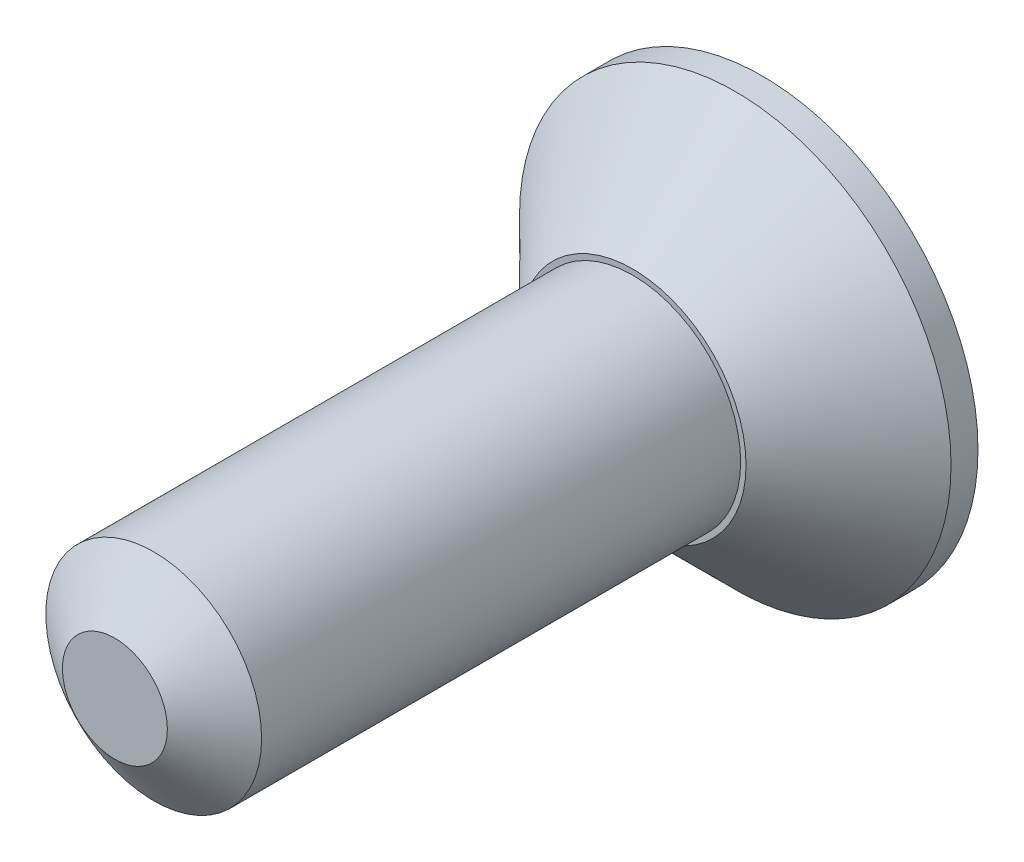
ISO-10303-21;
HEADER;
FILE_DESCRIPTION(('STEP AP214'),'2;1');
FILE_NAME('part.step','',(''),(''),'','','');
FILE_SCHEMA(('AUTOMOTIVE_DESIGN { 1 0 10303 214 1 1 1 1 }'));
ENDSEC;
DATA;
#1=APPLICATION_CONTEXT('core data for automotive mechanical design processes');
#2=APPLICATION_PROTOCOL_DEFINITION('international standard','automotive_design',2000,#1);
#3=PRODUCT_CONTEXT('',#1,'mechanical');
#4=PRODUCT('Part','Part','',(#3));
#5=PRODUCT_RELATED_PRODUCT_CATEGORY('part','',(#4));
#6=PRODUCT_DEFINITION_FORMATION('','',#4);
#7=PRODUCT_DEFINITION_CONTEXT('part definition',#1,'design');
#8=PRODUCT_DEFINITION('design','',#6,#7);
#9=PRODUCT_DEFINITION_SHAPE('','',#8);
#10=(LENGTH_UNIT() NAMED_UNIT(*) SI_UNIT(.MILLI.,.METRE.));
#11=(NAMED_UNIT(*) PLANE_ANGLE_UNIT() SI_UNIT($,.RADIAN.));
#12=(NAMED_UNIT(*) SI_UNIT($,.STERADIAN.) SOLID_ANGLE_UNIT());
#13=UNCERTAINTY_MEASURE_WITH_UNIT(LENGTH_MEASURE(1.E-05),#10,'distance_accuracy_value','');
#14=(GEOMETRIC_REPRESENTATION_CONTEXT(3) GLOBAL_UNCERTAINTY_ASSIGNED_CONTEXT((#13)) GLOBAL_UNIT_ASSIGNED_CONTEXT((#10,
#11,#12)) REPRESENTATION_CONTEXT('',''));
#15=CARTESIAN_POINT('',(0.,0.,0.));
#16=DIRECTION('',(0.,0.,1.));
#17=DIRECTION('',(1.,0.,0.));
#18=AXIS2_PLACEMENT_3D('',#15,#16,#17);
#19=CARTESIAN_POINT('',(0.,0.,-6.));
#20=DIRECTION('',(0.,0.,1.));
#21=DIRECTION('',(1.,0.,0.));
#22=AXIS2_PLACEMENT_3D('',#19,#20,#21);
#23=PLANE('',#22);
#24=CARTESIAN_POINT('',(0.,0.,-6.));
#25=DIRECTION('',(0.,0.,-1.));
#26=DIRECTION('',(-1.,0.,0.));
#27=AXIS2_PLACEMENT_3D('',#24,#25,#26);
#28=CIRCLE('',#27,2.);
#29=CARTESIAN_POINT('',(-2.,0.,-6.));
#30=VERTEX_POINT('',#29);
#31=EDGE_CURVE('E132',#30,#30,#28,.T.);
#32=ORIENTED_EDGE('',*,*,#31,.T.);
#33=EDGE_LOOP('',(#32));
#34=FACE_BOUND('',#33,.T.);
#35=CARTESIAN_POINT('',(0.,0.,-6.));
#36=DIRECTION('',(0.,0.,1.));
#37=DIRECTION('',(1.,0.,0.));
#38=AXIS2_PLACEMENT_3D('',#35,#36,#37);
#39=CIRCLE('',#38,0.750555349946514);
#40=CARTESIAN_POINT('',(0.,-0.750555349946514,-6.));
#41=VERTEX_POINT('',#40);
#42=CARTESIAN_POINT('',(0.649999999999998,-0.375277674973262,-6.));
#43=VERTEX_POINT('',#42);
#44=EDGE_CURVE('E209',#41,#43,#39,.T.);
#45=ORIENTED_EDGE('',*,*,#44,.T.);
#46=CARTESIAN_POINT('',(0.649999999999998,0.375277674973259,-6.));
#47=VERTEX_POINT('',#46);
#48=EDGE_CURVE('E206',#43,#47,#39,.T.);
#49=ORIENTED_EDGE('',*,*,#48,.T.);
#50=CARTESIAN_POINT('',(0.,0.750555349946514,-6.));
#51=VERTEX_POINT('',#50);
#52=EDGE_CURVE('E202',#47,#51,#39,.T.);
#53=ORIENTED_EDGE('',*,*,#52,.T.);
#54=CARTESIAN_POINT('',(-0.649999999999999,0.375277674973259,-6.));
#55=VERTEX_POINT('',#54);
#56=EDGE_CURVE('E55',#51,#55,#39,.T.);
#57=ORIENTED_EDGE('',*,*,#56,.T.);
#58=CARTESIAN_POINT('',(-0.650000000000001,-0.375277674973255,-6.));
#59=VERTEX_POINT('',#58);
#60=EDGE_CURVE('E62',#55,#59,#39,.T.);
#61=ORIENTED_EDGE('',*,*,#60,.T.);
#62=EDGE_CURVE('E211',#59,#41,#39,.T.);
#63=ORIENTED_EDGE('',*,*,#62,.T.);
#64=EDGE_LOOP('',(#45,#49,#53,#57,#61,#63));
#65=FACE_BOUND('',#64,.T.);
#66=ADVANCED_FACE('F36',(#34,#65),#23,.F.);
#67=CARTESIAN_POINT('',(0.,0.,-6.));
#68=DIRECTION('',(0.,0.,1.));
#69=DIRECTION('',(1.,0.,0.));
#70=AXIS2_PLACEMENT_3D('',#67,#68,#69);
#71=CYLINDRICAL_SURFACE('',#70,1.);
#72=CARTESIAN_POINT('',(0.,0.,-0.359771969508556));
#73=DIRECTION('',(0.,0.,1.));
#74=DIRECTION('',(1.,0.,0.));
#75=AXIS2_PLACEMENT_3D('',#72,#73,#74);
#76=CIRCLE('',#75,1.);
#77=CARTESIAN_POINT('',(1.,0.,-0.359771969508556));
#78=VERTEX_POINT('',#77);
#79=EDGE_CURVE('E49',#78,#78,#76,.T.);
#80=ORIENTED_EDGE('',*,*,#79,.F.);
#81=EDGE_LOOP('',(#80));
#82=FACE_BOUND('',#81,.T.);
#83=CARTESIAN_POINT('',(0.,0.,-4.8));
#84=DIRECTION('',(0.,0.,-1.));
#85=DIRECTION('',(-1.,0.,0.));
#86=AXIS2_PLACEMENT_3D('',#83,#84,#85);
#87=CIRCLE('',#86,1.);
#88=CARTESIAN_POINT('',(-1.,0.,-4.8));
#89=VERTEX_POINT('',#88);
#90=EDGE_CURVE('E135',#89,#89,#87,.F.);
#91=ORIENTED_EDGE('',*,*,#90,.T.);
#92=EDGE_LOOP('',(#91));
#93=FACE_BOUND('',#92,.T.);
#94=ADVANCED_FACE('F38',(#82,#93),#71,.T.);
#95=CARTESIAN_POINT('',(0.,0.,0.));
#96=DIRECTION('',(0.,0.,-1.));
#97=DIRECTION('',(-1.,0.,0.));
#98=AXIS2_PLACEMENT_3D('',#95,#96,#97);
#99=CONICAL_SURFACE('',#98,0.486192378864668,0.959931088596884);
#100=ORIENTED_EDGE('',*,*,#79,.T.);
#101=EDGE_LOOP('',(#100));
#102=FACE_BOUND('',#101,.T.);
#103=CARTESIAN_POINT('',(0.,0.,0.));
#104=DIRECTION('',(0.,0.,1.));
#105=DIRECTION('',(1.,0.,0.));
#106=AXIS2_PLACEMENT_3D('',#103,#104,#105);
#107=CIRCLE('',#106,0.486192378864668);
#108=CARTESIAN_POINT('',(0.486192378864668,0.,0.));
#109=VERTEX_POINT('',#108);
#110=EDGE_CURVE('E136',#109,#109,#107,.T.);
#111=ORIENTED_EDGE('',*,*,#110,.F.);
#112=EDGE_LOOP('',(#111));
#113=FACE_BOUND('',#112,.T.);
#114=ADVANCED_FACE('F157',(#102,#113),#99,.T.);
#115=CARTESIAN_POINT('',(0.,0.,0.));
#116=DIRECTION('',(0.,0.,1.));
#117=DIRECTION('',(1.,0.,0.));
#118=AXIS2_PLACEMENT_3D('',#115,#116,#117);
#119=PLANE('',#118);
#120=ORIENTED_EDGE('',*,*,#110,.T.);
#121=EDGE_LOOP('',(#120));
#122=FACE_BOUND('',#121,.T.);
#123=ADVANCED_FACE('F147',(#122),#119,.T.);
#124=CARTESIAN_POINT('',(0.,0.,-4.8));
#125=DIRECTION('',(0.,0.,-1.));
#126=DIRECTION('',(-1.,0.,0.));
#127=AXIS2_PLACEMENT_3D('',#124,#125,#126);
#128=PLANE('',#127);
#129=CARTESIAN_POINT('',(0.,0.,-4.8));
#130=DIRECTION('',(0.,0.,1.));
#131=DIRECTION('',(1.,0.,0.));
#132=AXIS2_PLACEMENT_3D('',#129,#130,#131);
#133=CIRCLE('',#132,1.05);
#134=CARTESIAN_POINT('',(1.05,0.,-4.8));
#135=VERTEX_POINT('',#134);
#136=EDGE_CURVE('E120',#135,#135,#133,.T.);
#137=ORIENTED_EDGE('',*,*,#136,.T.);
#138=EDGE_LOOP('',(#137));
#139=FACE_BOUND('',#138,.T.);
#140=ORIENTED_EDGE('',*,*,#90,.F.);
#141=EDGE_LOOP('',(#140));
#142=FACE_BOUND('',#141,.T.);
#143=ADVANCED_FACE('F144',(#139,#142),#128,.F.);
#144=CARTESIAN_POINT('',(0.,0.,-5.75000000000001));
#145=DIRECTION('',(0.,0.,-1.));
#146=DIRECTION('',(-1.,0.,0.));
#147=AXIS2_PLACEMENT_3D('',#144,#145,#146);
#148=CONICAL_SURFACE('',#147,2.,0.785398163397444);
#149=ORIENTED_EDGE('',*,*,#136,.F.);
#150=EDGE_LOOP('',(#149));
#151=FACE_BOUND('',#150,.T.);
#152=CARTESIAN_POINT('',(0.,0.,-5.75000000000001));
#153=DIRECTION('',(0.,0.,1.));
#154=DIRECTION('',(1.,0.,0.));
#155=AXIS2_PLACEMENT_3D('',#152,#153,#154);
#156=CIRCLE('',#155,2.);
#157=CARTESIAN_POINT('',(2.,0.,-5.75000000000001));
#158=VERTEX_POINT('',#157);
#159=EDGE_CURVE('E124',#158,#158,#156,.T.);
#160=ORIENTED_EDGE('',*,*,#159,.T.);
#161=EDGE_LOOP('',(#160));
#162=FACE_BOUND('',#161,.T.);
#163=ADVANCED_FACE('F146',(#151,#162),#148,.T.);
#164=CARTESIAN_POINT('',(0.,0.,-4.8));
#165=DIRECTION('',(0.,0.,-1.));
#166=DIRECTION('',(-1.,0.,0.));
#167=AXIS2_PLACEMENT_3D('',#164,#165,#166);
#168=CYLINDRICAL_SURFACE('',#167,2.);
#169=ORIENTED_EDGE('',*,*,#159,.F.);
#170=EDGE_LOOP('',(#169));
#171=FACE_BOUND('',#170,.T.);
#172=ORIENTED_EDGE('',*,*,#31,.F.);
#173=EDGE_LOOP('',(#172));
#174=FACE_BOUND('',#173,.T.);
#175=ADVANCED_FACE('F154',(#171,#174),#168,.T.);
#176=CARTESIAN_POINT('',(0.,0.,-6.));
#177=DIRECTION('',(0.,0.,-1.));
#178=DIRECTION('',(1.,0.,0.));
#179=AXIS2_PLACEMENT_3D('',#176,#177,#178);
#180=CONICAL_SURFACE('',#179,0.750555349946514,0.78539816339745);
#181=ORIENTED_EDGE('',*,*,#48,.F.);
#182=CARTESIAN_POINT('',(0.649999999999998,-0.748456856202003,-6.24075069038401));
#183=CARTESIAN_POINT('',(0.649999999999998,-0.711991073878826,-6.21328028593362));
#184=CARTESIAN_POINT('',(0.649999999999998,-0.675139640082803,-6.1862651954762));
#185=CARTESIAN_POINT('',(0.649999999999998,-0.600031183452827,-6.13362934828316));
#186=CARTESIAN_POINT('',(0.649999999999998,-0.561765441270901,-6.1080211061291));
#187=CARTESIAN_POINT('',(0.649999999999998,-0.481525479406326,-6.05773749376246));
#188=CARTESIAN_POINT('',(0.649999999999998,-0.439464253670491,-6.03319880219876));
#189=CARTESIAN_POINT('',(0.649999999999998,-0.353242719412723,-5.98831465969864));
#190=CARTESIAN_POINT('',(0.649999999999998,-0.309090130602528,-5.96795507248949));
#191=CARTESIAN_POINT('',(0.649999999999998,-0.242810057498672,-5.94304872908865));
#192=CARTESIAN_POINT('',(0.649999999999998,-0.221667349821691,-5.93590072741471));
#193=CARTESIAN_POINT('',(0.649999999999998,-0.178882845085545,-5.92329752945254));
#194=CARTESIAN_POINT('',(0.649999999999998,-0.157241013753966,-5.91784244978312));
#195=CARTESIAN_POINT('',(0.649999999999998,-0.0924732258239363,-5.90466076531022));
#196=CARTESIAN_POINT('',(0.649999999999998,-0.0486986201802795,-5.89979355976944));
#197=CARTESIAN_POINT('',(0.649999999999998,0.0373331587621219,-5.89914448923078));
#198=CARTESIAN_POINT('',(0.649999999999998,0.0795879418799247,-5.9030403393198));
#199=CARTESIAN_POINT('',(0.649999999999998,0.142230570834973,-5.91449232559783));
#200=CARTESIAN_POINT('',(0.649999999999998,0.163174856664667,-5.91931456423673));
#201=CARTESIAN_POINT('',(0.649999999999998,0.204615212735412,-5.93060009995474));
#202=CARTESIAN_POINT('',(0.649999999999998,0.225111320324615,-5.93706325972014));
#203=CARTESIAN_POINT('',(0.649999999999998,0.289638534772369,-5.95984409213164));
#204=CARTESIAN_POINT('',(0.649999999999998,0.332748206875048,-5.9787572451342));
#205=CARTESIAN_POINT('',(0.649999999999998,0.416943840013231,-6.02081128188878));
#206=CARTESIAN_POINT('',(0.649999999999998,0.458021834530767,-6.04396735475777));
#207=CARTESIAN_POINT('',(0.649999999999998,0.536529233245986,-6.09172663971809));
#208=CARTESIAN_POINT('',(0.649999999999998,0.574038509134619,-6.11620075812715));
#209=CARTESIAN_POINT('',(0.649999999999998,0.647609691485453,-6.16662345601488));
#210=CARTESIAN_POINT('',(0.649999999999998,0.683680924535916,-6.19255834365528));
#211=CARTESIAN_POINT('',(0.649999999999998,0.719356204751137,-6.21896687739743));
#212=B_SPLINE_CURVE_WITH_KNOTS('',3,(#182,#183,#184,#185,#186,#187,#188,#189,#190,#191,#192,
#193,#194,#195,#196,#197,#198,#199,#200,#201,#202,#203,#204,#205,#206,#207,#208,#209,#210,#211),
.UNSPECIFIED.,.F.,.F.,(4,2,2,2,2,2,2,2,2,2,2,2,2,2,4),(0.,0.13701403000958,0.275096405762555,
0.421060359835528,0.566522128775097,0.633415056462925,0.700312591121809,0.831534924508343,
0.958010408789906,1.02242898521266,1.08684217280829,1.22766018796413,1.36899252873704,
1.50330165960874,1.63651263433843),.UNSPECIFIED.);
#213=EDGE_CURVE('E11',#47,#43,#212,.F.);
#214=ORIENTED_EDGE('',*,*,#213,.F.);
#215=EDGE_LOOP('',(#181,#214));
#216=FACE_BOUND('',#215,.T.);
#217=ADVANCED_FACE('F172',(#216),#180,.F.);
#218=ORIENTED_EDGE('',*,*,#44,.F.);
#219=CARTESIAN_POINT('',(0.650199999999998,-0.375162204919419,-6.00011549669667));
#220=CARTESIAN_POINT('',(0.627846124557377,-0.388068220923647,-5.98721736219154));
#221=CARTESIAN_POINT('',(0.605119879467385,-0.401189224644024,-5.97507515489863));
#222=CARTESIAN_POINT('',(0.558778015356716,-0.427944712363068,-5.95284224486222));
#223=CARTESIAN_POINT('',(0.535157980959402,-0.441581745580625,-5.94276392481));
#224=CARTESIAN_POINT('',(0.487526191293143,-0.469081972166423,-5.92550151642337));
#225=CARTESIAN_POINT('',(0.463526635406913,-0.48293812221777,-5.91827395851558));
#226=CARTESIAN_POINT('',(0.415010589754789,-0.510948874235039,-5.90712920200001));
#227=CARTESIAN_POINT('',(0.390495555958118,-0.52510263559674,-5.90320370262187));
#228=CARTESIAN_POINT('',(0.330615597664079,-0.559674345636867,-5.89822343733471));
#229=CARTESIAN_POINT('',(0.295110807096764,-0.580173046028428,-5.89912448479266));
#230=CARTESIAN_POINT('',(0.224845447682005,-0.620740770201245,-5.90840856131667));
#231=CARTESIAN_POINT('',(0.190086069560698,-0.640809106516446,-5.91680276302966));
#232=CARTESIAN_POINT('',(0.12904173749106,-0.676053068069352,-5.9370456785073));
#233=CARTESIAN_POINT('',(0.102476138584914,-0.691390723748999,-5.9478384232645));
#234=CARTESIAN_POINT('',(0.0503858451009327,-0.721465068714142,-5.9721519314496));
#235=CARTESIAN_POINT('',(0.0248580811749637,-0.73620353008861,-5.98566382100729));
#236=CARTESIAN_POINT('',(-0.000200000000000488,-0.750670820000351,-6.00011549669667));
#237=B_SPLINE_CURVE_WITH_KNOTS('',3,(#219,#220,#221,#222,#223,#224,#225,#226,#227,#228,#229,
#230,#231,#232,#233,#234,#235,#236),.UNSPECIFIED.,.F.,.F.,(4,2,2,2,2,2,2,2,4),(0.,
0.0866236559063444,0.173752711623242,0.259496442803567,0.345023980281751,0.467267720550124,
0.589694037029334,0.687111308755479,0.784215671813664),.UNSPECIFIED.);
#238=EDGE_CURVE('E204',#43,#41,#237,.T.);
#239=ORIENTED_EDGE('',*,*,#238,.F.);
#240=EDGE_LOOP('',(#218,#239));
#241=FACE_BOUND('',#240,.T.);
#242=ADVANCED_FACE('F177',(#241),#180,.F.);
#243=ORIENTED_EDGE('',*,*,#62,.F.);
#244=CARTESIAN_POINT('',(0.000199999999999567,-0.750670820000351,-6.00011549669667));
#245=CARTESIAN_POINT('',(-0.0221538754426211,-0.737764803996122,-5.98721736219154));
#246=CARTESIAN_POINT('',(-0.0448801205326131,-0.724643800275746,-5.97507515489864));
#247=CARTESIAN_POINT('',(-0.0912219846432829,-0.697888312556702,-5.95284224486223));
#248=CARTESIAN_POINT('',(-0.114842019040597,-0.684251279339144,-5.94276392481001));
#249=CARTESIAN_POINT('',(-0.162473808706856,-0.656751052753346,-5.92550151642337));
#250=CARTESIAN_POINT('',(-0.186473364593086,-0.642894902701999,-5.91827395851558));
#251=CARTESIAN_POINT('',(-0.234989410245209,-0.61488415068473,-5.90712920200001));
#252=CARTESIAN_POINT('',(-0.259504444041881,-0.600730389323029,-5.90320370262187));
#253=CARTESIAN_POINT('',(-0.31938440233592,-0.566158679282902,-5.89822343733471));
#254=CARTESIAN_POINT('',(-0.354889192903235,-0.545659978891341,-5.89912448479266));
#255=CARTESIAN_POINT('',(-0.425154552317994,-0.505092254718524,-5.90840856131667));
#256=CARTESIAN_POINT('',(-0.459913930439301,-0.485023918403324,-5.91680276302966));
#257=CARTESIAN_POINT('',(-0.520958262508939,-0.449779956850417,-5.9370456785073));
#258=CARTESIAN_POINT('',(-0.547523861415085,-0.43444230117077,-5.9478384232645));
#259=CARTESIAN_POINT('',(-0.599614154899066,-0.404367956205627,-5.9721519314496));
#260=CARTESIAN_POINT('',(-0.625141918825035,-0.38962949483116,-5.98566382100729));
#261=CARTESIAN_POINT('',(-0.650199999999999,-0.375162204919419,-6.00011549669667));
#262=B_SPLINE_CURVE_WITH_KNOTS('',3,(#244,#245,#246,#247,#248,#249,#250,#251,#252,#253,#254,
#255,#256,#257,#258,#259,#260,#261),.UNSPECIFIED.,.F.,.F.,(4,2,2,2,2,2,2,2,4),(0.,
0.0866236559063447,0.173752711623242,0.259496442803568,0.345023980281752,0.467267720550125,
0.589694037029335,0.687111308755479,0.784215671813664),.UNSPECIFIED.);
#263=EDGE_CURVE('E219',#41,#59,#262,.T.);
#264=ORIENTED_EDGE('',*,*,#263,.F.);
#265=EDGE_LOOP('',(#243,#264));
#266=FACE_BOUND('',#265,.T.);
#267=ADVANCED_FACE('F187',(#266),#180,.F.);
#268=ORIENTED_EDGE('',*,*,#60,.F.);
#269=CARTESIAN_POINT('',(-0.649999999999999,-0.748456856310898,-6.24075069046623));
#270=CARTESIAN_POINT('',(-0.649999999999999,-0.711991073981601,-6.21328028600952));
#271=CARTESIAN_POINT('',(-0.649999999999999,-0.675139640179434,-6.18626519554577));
#272=CARTESIAN_POINT('',(-0.649999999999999,-0.600031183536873,-6.13362934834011));
#273=CARTESIAN_POINT('',(-0.649999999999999,-0.561765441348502,-6.10802110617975));
#274=CARTESIAN_POINT('',(-0.649999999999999,-0.481525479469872,-6.05773749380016));
#275=CARTESIAN_POINT('',(-0.649999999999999,-0.439464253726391,-6.03319880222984));
#276=CARTESIAN_POINT('',(-0.649999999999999,-0.35324271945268,-5.98831465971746));
#277=CARTESIAN_POINT('',(-0.649999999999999,-0.309090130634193,-5.96795507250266));
#278=CARTESIAN_POINT('',(-0.649999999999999,-0.242810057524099,-5.94304872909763));
#279=CARTESIAN_POINT('',(-0.649999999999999,-0.221667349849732,-5.93590072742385));
#280=CARTESIAN_POINT('',(-0.649999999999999,-0.178882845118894,-5.92329752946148));
#281=CARTESIAN_POINT('',(-0.649999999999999,-0.157241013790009,-5.9178424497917));
#282=CARTESIAN_POINT('',(-0.649999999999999,-0.0924732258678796,-5.90466076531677));
#283=CARTESIAN_POINT('',(-0.649999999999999,-0.0486986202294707,-5.89979355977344));
#284=CARTESIAN_POINT('',(-0.649999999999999,0.0373331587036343,-5.89914448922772));
#285=CARTESIAN_POINT('',(-0.649999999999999,0.0795879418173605,-5.90304033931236));
#286=CARTESIAN_POINT('',(-0.649999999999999,0.142230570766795,-5.9144923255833));
#287=CARTESIAN_POINT('',(-0.649999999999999,0.163174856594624,-5.9193145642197));
#288=CARTESIAN_POINT('',(-0.649999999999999,0.204615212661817,-5.93060009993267));
#289=CARTESIAN_POINT('',(-0.649999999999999,0.225111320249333,-5.93706325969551));
#290=CARTESIAN_POINT('',(-0.649999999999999,0.289638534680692,-5.95984409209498));
#291=CARTESIAN_POINT('',(-0.649999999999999,0.332748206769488,-5.97875724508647));
#292=CARTESIAN_POINT('',(-0.649999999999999,0.41694383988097,-6.02081128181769));
#293=CARTESIAN_POINT('',(-0.649999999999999,0.458021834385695,-6.04396735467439));
#294=CARTESIAN_POINT('',(-0.649999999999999,0.536529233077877,-6.09172663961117));
#295=CARTESIAN_POINT('',(-0.649999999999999,0.574038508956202,-6.11620075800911));
#296=CARTESIAN_POINT('',(-0.649999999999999,0.647609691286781,-6.16662345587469));
#297=CARTESIAN_POINT('',(-0.649999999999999,0.683680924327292,-6.19255834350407));
#298=CARTESIAN_POINT('',(-0.649999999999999,0.719356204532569,-6.21896687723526));
#299=B_SPLINE_CURVE_WITH_KNOTS('',3,(#269,#270,#271,#272,#273,#274,#275,#276,#277,#278,#279,
#280,#281,#282,#283,#284,#285,#286,#287,#288,#289,#290,#291,#292,#293,#294,#295,#296,#297,#298),
.UNSPECIFIED.,.F.,.F.,(4,2,2,2,2,2,2,2,2,2,2,2,2,2,4),(0.,0.137014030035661,0.275096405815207,
0.421060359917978,0.566522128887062,0.633415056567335,0.700312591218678,0.83153492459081,
0.958010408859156,1.02242898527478,1.08684217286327,1.22766018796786,1.36899252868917,
1.50330165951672,1.63651263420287),.UNSPECIFIED.);
#300=EDGE_CURVE('E242',#59,#55,#299,.T.);
#301=ORIENTED_EDGE('',*,*,#300,.F.);
#302=EDGE_LOOP('',(#268,#301));
#303=FACE_BOUND('',#302,.T.);
#304=ADVANCED_FACE('F200',(#303),#180,.F.);
#305=ORIENTED_EDGE('',*,*,#56,.F.);
#306=CARTESIAN_POINT('',(-0.650199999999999,0.37516220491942,-6.00011549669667));
#307=CARTESIAN_POINT('',(-0.627846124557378,0.388068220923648,-5.98721736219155));
#308=CARTESIAN_POINT('',(-0.605119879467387,0.401189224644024,-5.97507515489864));
#309=CARTESIAN_POINT('',(-0.558778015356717,0.427944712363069,-5.95284224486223));
#310=CARTESIAN_POINT('',(-0.535157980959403,0.441581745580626,-5.94276392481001));
#311=CARTESIAN_POINT('',(-0.487526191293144,0.469081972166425,-5.92550151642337));
#312=CARTESIAN_POINT('',(-0.463526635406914,0.482938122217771,-5.91827395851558));
#313=CARTESIAN_POINT('',(-0.41501058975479,0.51094887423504,-5.90712920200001));
#314=CARTESIAN_POINT('',(-0.390495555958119,0.525102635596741,-5.90320370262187));
#315=CARTESIAN_POINT('',(-0.33061559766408,0.559674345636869,-5.89822343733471));
#316=CARTESIAN_POINT('',(-0.295110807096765,0.580173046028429,-5.89912448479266));
#317=CARTESIAN_POINT('',(-0.224845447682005,0.620740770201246,-5.90840856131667));
#318=CARTESIAN_POINT('',(-0.190086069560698,0.640809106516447,-5.91680276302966));
#319=CARTESIAN_POINT('',(-0.12904173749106,0.676053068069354,-5.9370456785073));
#320=CARTESIAN_POINT('',(-0.102476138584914,0.691390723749,-5.9478384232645));
#321=CARTESIAN_POINT('',(-0.0503858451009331,0.721465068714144,-5.9721519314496));
#322=CARTESIAN_POINT('',(-0.0248580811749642,0.736203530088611,-5.98566382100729));
#323=CARTESIAN_POINT('',(0.000200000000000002,0.750670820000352,-6.00011549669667));
#324=B_SPLINE_CURVE_WITH_KNOTS('',3,(#306,#307,#308,#309,#310,#311,#312,#313,#314,#315,#316,
#317,#318,#319,#320,#321,#322,#323),.UNSPECIFIED.,.F.,.F.,(4,2,2,2,2,2,2,2,4),(0.,
0.0866236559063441,0.173752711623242,0.259496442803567,0.345023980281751,0.467267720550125,
0.589694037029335,0.68711130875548,0.784215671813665),.UNSPECIFIED.);
#325=EDGE_CURVE('E119',#55,#51,#324,.T.);
#326=ORIENTED_EDGE('',*,*,#325,.F.);
#327=EDGE_LOOP('',(#305,#326));
#328=FACE_BOUND('',#327,.T.);
#329=ADVANCED_FACE('F193',(#328),#180,.F.);
#330=ORIENTED_EDGE('',*,*,#52,.F.);
#331=CARTESIAN_POINT('',(-0.000200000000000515,0.750670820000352,-6.00011549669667));
#332=CARTESIAN_POINT('',(0.0221538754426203,0.737764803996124,-5.98721736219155));
#333=CARTESIAN_POINT('',(0.0448801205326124,0.724643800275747,-5.97507515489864));
#334=CARTESIAN_POINT('',(0.0912219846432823,0.697888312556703,-5.95284224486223));
#335=CARTESIAN_POINT('',(0.114842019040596,0.684251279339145,-5.94276392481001));
#336=CARTESIAN_POINT('',(0.162473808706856,0.656751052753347,-5.92550151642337));
#337=CARTESIAN_POINT('',(0.186473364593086,0.642894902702,-5.91827395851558));
#338=CARTESIAN_POINT('',(0.234989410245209,0.614884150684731,-5.90712920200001));
#339=CARTESIAN_POINT('',(0.259504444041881,0.60073038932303,-5.90320370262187));
#340=CARTESIAN_POINT('',(0.31938440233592,0.566158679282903,-5.89822343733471));
#341=CARTESIAN_POINT('',(0.354889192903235,0.545659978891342,-5.89912448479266));
#342=CARTESIAN_POINT('',(0.425154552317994,0.505092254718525,-5.90840856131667));
#343=CARTESIAN_POINT('',(0.459913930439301,0.485023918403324,-5.91680276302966));
#344=CARTESIAN_POINT('',(0.520958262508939,0.449779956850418,-5.9370456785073));
#345=CARTESIAN_POINT('',(0.547523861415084,0.434442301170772,-5.9478384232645));
#346=CARTESIAN_POINT('',(0.599614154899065,0.404367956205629,-5.9721519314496));
#347=CARTESIAN_POINT('',(0.625141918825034,0.389629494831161,-5.98566382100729));
#348=CARTESIAN_POINT('',(0.650199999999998,0.37516220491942,-6.00011549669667));
#349=B_SPLINE_CURVE_WITH_KNOTS('',3,(#331,#332,#333,#334,#335,#336,#337,#338,#339,#340,#341,
#342,#343,#344,#345,#346,#347,#348),.UNSPECIFIED.,.F.,.F.,(4,2,2,2,2,2,2,2,4),(0.,
0.086623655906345,0.173752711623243,0.259496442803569,0.345023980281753,0.467267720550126,
0.589694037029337,0.68711130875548,0.784215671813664),.UNSPECIFIED.);
#350=EDGE_CURVE('E115',#51,#47,#349,.T.);
#351=ORIENTED_EDGE('',*,*,#350,.F.);
#352=EDGE_LOOP('',(#330,#351));
#353=FACE_BOUND('',#352,.T.);
#354=ADVANCED_FACE('F179',(#353),#180,.F.);
#355=CARTESIAN_POINT('',(-0.649999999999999,1.12583302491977,-5.025));
#356=DIRECTION('',(0.,0.,1.));
#357=DIRECTION('',(1.,0.,0.));
#358=AXIS2_PLACEMENT_3D('',#355,#356,#357);
#359=PLANE('',#358);
#360=DIRECTION('',(-0.866025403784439,0.5,0.));
#361=VECTOR('',#360,1.);
#362=CARTESIAN_POINT('',(0.649999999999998,0.375277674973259,-5.025));
#363=LINE('',#362,#361);
#364=CARTESIAN_POINT('',(0.649999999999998,0.375277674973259,-5.025));
#365=VERTEX_POINT('',#364);
#366=CARTESIAN_POINT('',(0.,0.750555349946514,-5.025));
#367=VERTEX_POINT('',#366);
#368=EDGE_CURVE('E99',#365,#367,#363,.T.);
#369=ORIENTED_EDGE('',*,*,#368,.F.);
#370=DIRECTION('',(0.,1.,0.));
#371=VECTOR('',#370,1.);
#372=CARTESIAN_POINT('',(0.649999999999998,-0.375277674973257,-5.025));
#373=LINE('',#372,#371);
#374=CARTESIAN_POINT('',(0.649999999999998,-0.375277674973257,-5.025));
#375=VERTEX_POINT('',#374);
#376=EDGE_CURVE('E345',#375,#365,#373,.T.);
#377=ORIENTED_EDGE('',*,*,#376,.F.);
#378=DIRECTION('',(0.866025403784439,0.5,0.));
#379=VECTOR('',#378,1.);
#380=CARTESIAN_POINT('',(0.,-0.750555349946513,-5.025));
#381=LINE('',#380,#379);
#382=CARTESIAN_POINT('',(0.,-0.750555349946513,-5.025));
#383=VERTEX_POINT('',#382);
#384=EDGE_CURVE('E347',#383,#375,#381,.T.);
#385=ORIENTED_EDGE('',*,*,#384,.F.);
#386=DIRECTION('',(0.866025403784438,-0.5,0.));
#387=VECTOR('',#386,1.);
#388=CARTESIAN_POINT('',(-0.649999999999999,-0.375277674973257,-5.025));
#389=LINE('',#388,#387);
#390=CARTESIAN_POINT('',(-0.649999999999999,-0.375277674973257,-5.025));
#391=VERTEX_POINT('',#390);
#392=EDGE_CURVE('E349',#391,#383,#389,.T.);
#393=ORIENTED_EDGE('',*,*,#392,.F.);
#394=DIRECTION('',(0.,-1.,0.));
#395=VECTOR('',#394,1.);
#396=CARTESIAN_POINT('',(-0.649999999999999,0.375277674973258,-5.025));
#397=LINE('',#396,#395);
#398=CARTESIAN_POINT('',(-0.649999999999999,0.375277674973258,-5.025));
#399=VERTEX_POINT('',#398);
#400=EDGE_CURVE('E101',#399,#391,#397,.T.);
#401=ORIENTED_EDGE('',*,*,#400,.F.);
#402=DIRECTION('',(-0.866025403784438,-0.5,0.));
#403=VECTOR('',#402,1.);
#404=CARTESIAN_POINT('',(0.,0.750555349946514,-5.025));
#405=LINE('',#404,#403);
#406=EDGE_CURVE('E95',#367,#399,#405,.T.);
#407=ORIENTED_EDGE('',*,*,#406,.F.);
#408=EDGE_LOOP('',(#369,#377,#385,#393,#401,#407));
#409=FACE_BOUND('',#408,.T.);
#410=ADVANCED_FACE('F97',(#409),#359,.F.);
#411=CARTESIAN_POINT('',(0.649999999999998,-0.375277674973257,-5.025));
#412=DIRECTION('',(-1.,0.,0.));
#413=DIRECTION('',(0.,0.,1.));
#414=AXIS2_PLACEMENT_3D('',#411,#412,#413);
#415=PLANE('',#414);
#416=DIRECTION('',(0.,0.,-1.));
#417=VECTOR('',#416,1.);
#418=CARTESIAN_POINT('',(0.649999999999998,0.375277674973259,-5.025));
#419=LINE('',#418,#417);
#420=EDGE_CURVE('E114',#365,#47,#419,.T.);
#421=ORIENTED_EDGE('',*,*,#420,.T.);
#422=ORIENTED_EDGE('',*,*,#213,.T.);
#423=DIRECTION('',(0.,0.,-1.));
#424=VECTOR('',#423,1.);
#425=CARTESIAN_POINT('',(0.649999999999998,-0.375277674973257,-5.025));
#426=LINE('',#425,#424);
#427=EDGE_CURVE('E339',#375,#43,#426,.T.);
#428=ORIENTED_EDGE('',*,*,#427,.F.);
#429=ORIENTED_EDGE('',*,*,#376,.T.);
#430=EDGE_LOOP('',(#421,#422,#428,#429));
#431=FACE_BOUND('',#430,.T.);
#432=ADVANCED_FACE('F199',(#431),#415,.T.);
#433=CARTESIAN_POINT('',(0.,-0.750555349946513,-5.025));
#434=DIRECTION('',(-0.5,0.866025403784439,0.));
#435=DIRECTION('',(-0.866025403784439,-0.5,0.));
#436=AXIS2_PLACEMENT_3D('',#433,#434,#435);
#437=PLANE('',#436);
#438=ORIENTED_EDGE('',*,*,#427,.T.);
#439=ORIENTED_EDGE('',*,*,#238,.T.);
#440=DIRECTION('',(0.,0.,-1.));
#441=VECTOR('',#440,1.);
#442=CARTESIAN_POINT('',(0.,-0.750555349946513,-5.025));
#443=LINE('',#442,#441);
#444=EDGE_CURVE('E338',#383,#41,#443,.T.);
#445=ORIENTED_EDGE('',*,*,#444,.F.);
#446=ORIENTED_EDGE('',*,*,#384,.T.);
#447=EDGE_LOOP('',(#438,#439,#445,#446));
#448=FACE_BOUND('',#447,.T.);
#449=ADVANCED_FACE('F225',(#448),#437,.T.);
#450=CARTESIAN_POINT('',(-0.649999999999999,-0.375277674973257,-5.025));
#451=DIRECTION('',(0.5,0.866025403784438,0.));
#452=DIRECTION('',(-0.866025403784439,0.5,0.));
#453=AXIS2_PLACEMENT_3D('',#450,#451,#452);
#454=PLANE('',#453);
#455=ORIENTED_EDGE('',*,*,#444,.T.);
#456=ORIENTED_EDGE('',*,*,#263,.T.);
#457=DIRECTION('',(0.,0.,-1.));
#458=VECTOR('',#457,1.);
#459=CARTESIAN_POINT('',(-0.649999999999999,-0.375277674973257,-5.025));
#460=LINE('',#459,#458);
#461=EDGE_CURVE('E126',#391,#59,#460,.T.);
#462=ORIENTED_EDGE('',*,*,#461,.F.);
#463=ORIENTED_EDGE('',*,*,#392,.T.);
#464=EDGE_LOOP('',(#455,#456,#462,#463));
#465=FACE_BOUND('',#464,.T.);
#466=ADVANCED_FACE('F228',(#465),#454,.T.);
#467=CARTESIAN_POINT('',(-0.649999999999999,0.375277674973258,-5.025));
#468=DIRECTION('',(1.,0.,0.));
#469=DIRECTION('',(0.,1.,0.));
#470=AXIS2_PLACEMENT_3D('',#467,#468,#469);
#471=PLANE('',#470);
#472=ORIENTED_EDGE('',*,*,#461,.T.);
#473=ORIENTED_EDGE('',*,*,#300,.T.);
#474=DIRECTION('',(0.,0.,-1.));
#475=VECTOR('',#474,1.);
#476=CARTESIAN_POINT('',(-0.649999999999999,0.375277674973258,-5.025));
#477=LINE('',#476,#475);
#478=EDGE_CURVE('E121',#399,#55,#477,.T.);
#479=ORIENTED_EDGE('',*,*,#478,.F.);
#480=ORIENTED_EDGE('',*,*,#400,.T.);
#481=EDGE_LOOP('',(#472,#473,#479,#480));
#482=FACE_BOUND('',#481,.T.);
#483=ADVANCED_FACE('F234',(#482),#471,.T.);
#484=CARTESIAN_POINT('',(0.,0.750555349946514,-5.025));
#485=DIRECTION('',(0.5,-0.866025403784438,0.));
#486=DIRECTION('',(0.866025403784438,0.500000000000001,0.));
#487=AXIS2_PLACEMENT_3D('',#484,#485,#486);
#488=PLANE('',#487);
#489=ORIENTED_EDGE('',*,*,#478,.T.);
#490=ORIENTED_EDGE('',*,*,#325,.T.);
#491=DIRECTION('',(0.,0.,-1.));
#492=VECTOR('',#491,1.);
#493=CARTESIAN_POINT('',(0.,0.750555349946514,-5.025));
#494=LINE('',#493,#492);
#495=EDGE_CURVE('E112',#367,#51,#494,.T.);
#496=ORIENTED_EDGE('',*,*,#495,.F.);
#497=ORIENTED_EDGE('',*,*,#406,.T.);
#498=EDGE_LOOP('',(#489,#490,#496,#497));
#499=FACE_BOUND('',#498,.T.);
#500=ADVANCED_FACE('F118',(#499),#488,.T.);
#501=CARTESIAN_POINT('',(0.649999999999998,0.375277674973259,-5.025));
#502=DIRECTION('',(-0.5,-0.866025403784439,0.));
#503=DIRECTION('',(0.866025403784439,-0.5,0.));
#504=AXIS2_PLACEMENT_3D('',#501,#502,#503);
#505=PLANE('',#504);
#506=ORIENTED_EDGE('',*,*,#495,.T.);
#507=ORIENTED_EDGE('',*,*,#350,.T.);
#508=ORIENTED_EDGE('',*,*,#420,.F.);
#509=ORIENTED_EDGE('',*,*,#368,.T.);
#510=EDGE_LOOP('',(#506,#507,#508,#509));
#511=FACE_BOUND('',#510,.T.);
#512=ADVANCED_FACE('F110',(#511),#505,.T.);
#513=CLOSED_SHELL('',(#66,#94,#114,#123,#143,#163,#175,#217,#242,#267,#304,#329,#354,#410,#432,
#449,#466,#483,#500,#512));
#514=MANIFOLD_SOLID_BREP('B2',#513);
#515=ADVANCED_BREP_SHAPE_REPRESENTATION('',(#18,#514),#14);
#516=SHAPE_DEFINITION_REPRESENTATION(#9,#515);
ENDSEC;
END-ISO-10303-21;
